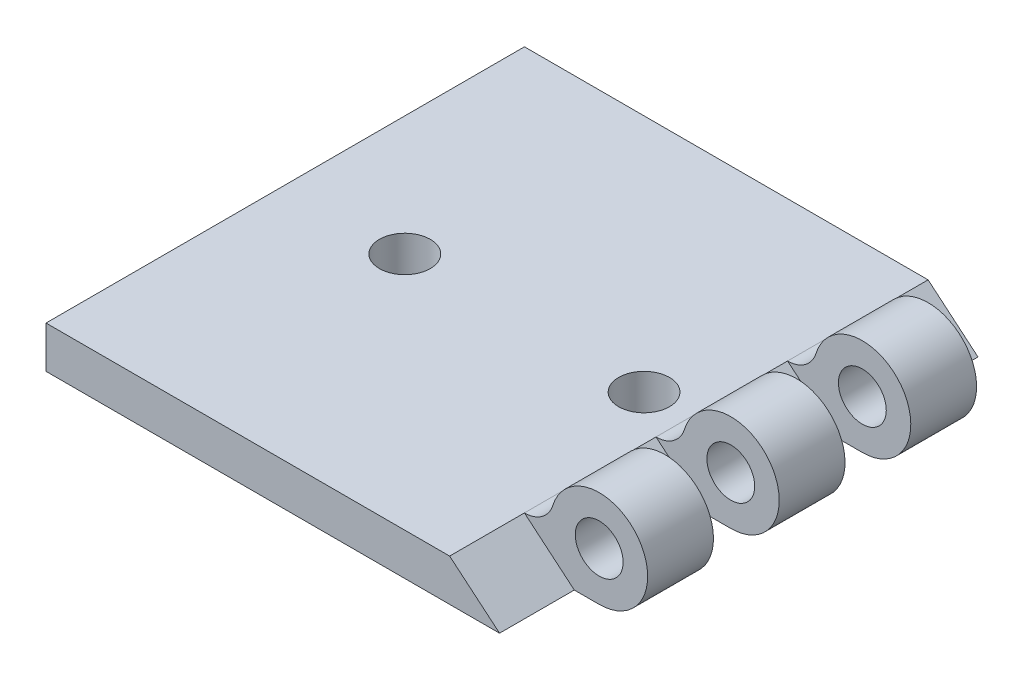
from build123d import *

# Parameters (mm, degrees)
SKIZZE1_R                       = 4
LINEAR_AUSTRAGEN1_DEPTH         = 80
SKIZZE2_W                       = 12.5
SKIZZE2_H                       = 26.745741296
SKIZZE2_W_2                     = 11
SCHNITT_LINEAR_AUSTRAGEN1_DEPTH = 107.172186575
SKIZZE3_R                       = 4.25
SCHNITT_LINEAR_AUSTRAGEN2_DEPTH = 115.291032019


with BuildPart() as part:
    # Skizze1 → Linear austragen1 (new body)
    with BuildSketch(Plane.XY):
        with BuildLine():
            Line((0, 0), (-80, 0))
            Line((-80, 0), (-80, 7))
            Line((-80, 7), (-12.505998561, 7))
            ThreePointArc((-12.505998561, 7), (-9.543123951, 7.972423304), (-7.732716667, 10.511450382))
            ThreePointArc((-7.732716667, 10.511450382), (6.524674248, 12.899856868), (0, 0))
        make_face()
        with Locations((0, 8.1)):
            Circle(SKIZZE1_R, mode=Mode.SUBTRACT)
    extrude(amount=LINEAR_AUSTRAGEN1_DEPTH)

    # Skizze2 → Schnitt-Linear austragen1 (cut, through all)
    with BuildSketch(Plane(origin=(-10.785648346, 9.050233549, 0), x_dir=(0, 0, 1), z_dir=(0.7660444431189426, -0.6427876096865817, 0))):
        with Locations((73.75, -10.696480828)):
            Rectangle(SKIZZE2_W, SKIZZE2_H)
        with Locations((51, -10.696480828)):
            Rectangle(SKIZZE2_W_2, SKIZZE2_H)
        with Locations((29, -10.696480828)):
            Rectangle(SKIZZE2_W_2, SKIZZE2_H)
        with Locations((6.25, -10.696480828)):
            Rectangle(SKIZZE2_W, SKIZZE2_H)
    extrude(amount=SCHNITT_LINEAR_AUSTRAGEN1_DEPTH, mode=Mode.SUBTRACT)

    # Skizze3 → Schnitt-Linear austragen2 (cut, through all)
    with BuildSketch(Plane.XZ):
        with Locations((-60, 40)):
            Circle(SKIZZE3_R)
        with Locations((-20, 40)):
            Circle(SKIZZE3_R)
    extrude(amount=-SCHNITT_LINEAR_AUSTRAGEN2_DEPTH, mode=Mode.SUBTRACT)


solid = part.part
